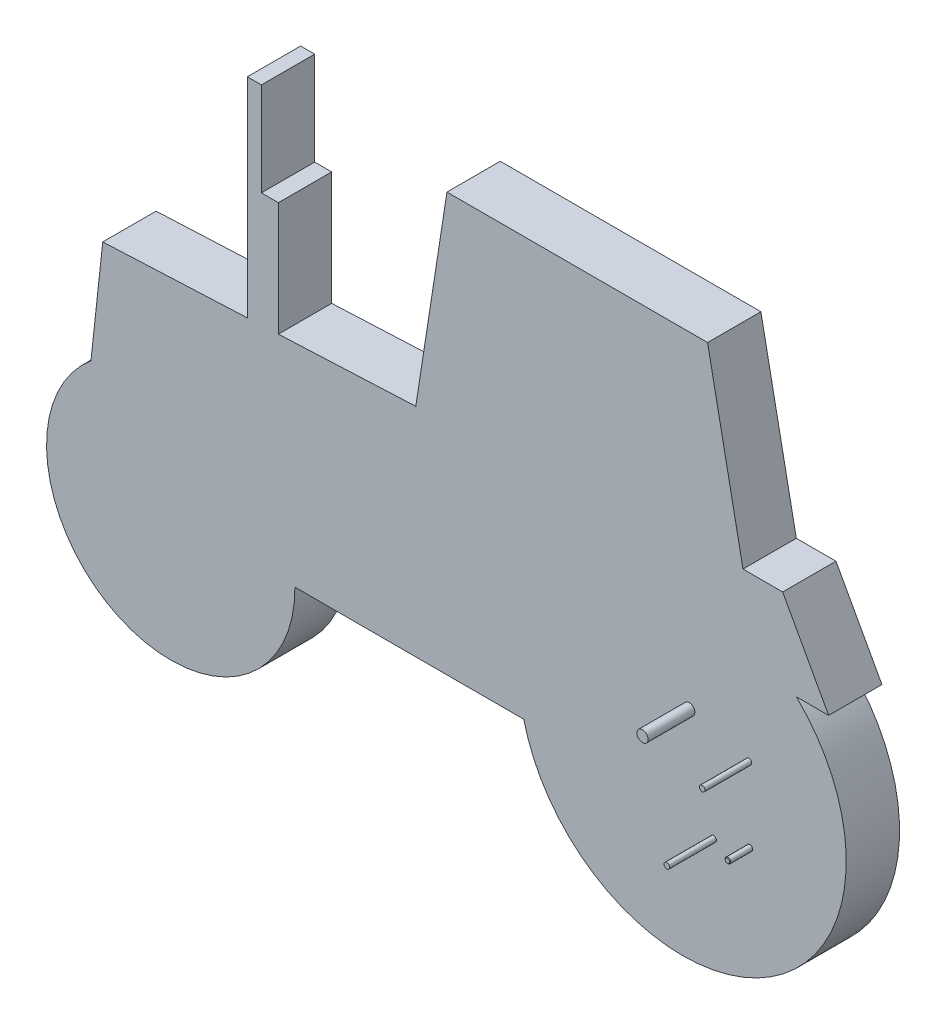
from build123d import *

# Parameters (mm, degrees)
ESQUISSE1_R      = 23.292005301
ESQUISSE1_R_2    = 30.670337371
EXTRUSION1_DEPTH = 10
ECHELLE1_SCALE   = 28.5
ESQUISSE2_R      = 15
ESQUISSE2_R_2    = 30
EXTRUSION2_DEPTH = 250
ESQUISSE3_R      = 15
EXTRUSION3_DEPTH = 120
CHANFREIN1_SIZE  = 3


with BuildPart() as part:
    # Esquisse1 → Extrusion1 (new body)
    with BuildSketch(Plane.XY):
        with Locations((-41.54999006, -49.050195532)):
            Circle(ESQUISSE1_R)
        with Locations((54.488942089, -41.671863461)):
            Circle(ESQUISSE1_R_2)
        with BuildLine():
            ThreePointArc((-56.512746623, -31.199889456), (-31.796262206, -27.898781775), (-18.258931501, -48.840190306))
            Line((-18.258931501, -48.840190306), (24.66806543, -48.840190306))
            ThreePointArc((24.66806543, -48.840190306), (39.272045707, -15.042637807), (75.804316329, -19.619099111))
            Line((75.804316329, -19.619099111), (81.85562556, -19.619099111))
            Line((81.85562556, -19.619099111), (73.230662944, -3.881883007))
            Line((73.230662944, -3.881883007), (65.791176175, -3.881883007))
            Line((65.791176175, -3.881883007), (59.148777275, 29.595807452))
            Line((59.148777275, 29.595807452), (10.260721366, 29.595807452))
            Line((10.260721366, 29.595807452), (4.415410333, -8.133018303))
            Line((4.415410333, -8.133018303), (-21.357097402, -9.299195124))
            Line((-21.357097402, -9.299195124), (-27.18579599, -9.562937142))
            Line((-27.18579599, -9.562937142), (-54.303395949, -10.789977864))
            Line((-54.303395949, -10.789977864), (-56.512746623, -31.199889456))
        make_face()
        Polygon((-27.18579599, 29.595807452), (-27.18579599, -9.562937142), (-21.357097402, -9.299195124), (-21.357097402, 12.059874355), (-24.545448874, 12.059874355), (-24.545448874, 29.595807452), align=None)
    extrude(amount=EXTRUSION1_DEPTH)


with BuildPart() as part_1:
    # Echelle1: scaled about (16.494977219, -25.916979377, 5)
    add(part.part.scale(ECHELLE1_SCALE).moved(Location((-453.611873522, 712.716932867, -137.5))))

    # Esquisse2 → Extrusion2 (add)
    with BuildSketch(Plane.XY.offset(147.5)):
        with Locations(Location((1264.322976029, -724.931175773, 0), (0, 0, 180))):
            Circle(ESQUISSE2_R)
        with Locations(Location((1134.322976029, -189.931175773, 0), (0, 0, 180))):
            Circle(ESQUISSE2_R_2)
        with Locations(Location((1453.322976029, -272.931175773, 0), (0, 0, 180))):
            Circle(ESQUISSE2_R)
    extrude(amount=EXTRUSION2_DEPTH)

    # Esquisse3 → Extrusion3 (add)
    with BuildSketch(Plane.XY.offset(147.5)):
        with Locations(Location((1458.291390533, -669.931175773, 0), (0, 0, 180))):
            Circle(ESQUISSE3_R)
    extrude(amount=EXTRUSION3_DEPTH)

    # Chanfrein1
    chanfrein1_edges = [part_1.edges().sort_by_distance(p)[0] for p in [
        (1473.291390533, -669.931175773, 267.5),
    ]]
    chamfer(chanfrein1_edges, length=CHANFREIN1_SIZE)


solid = part_1.part
